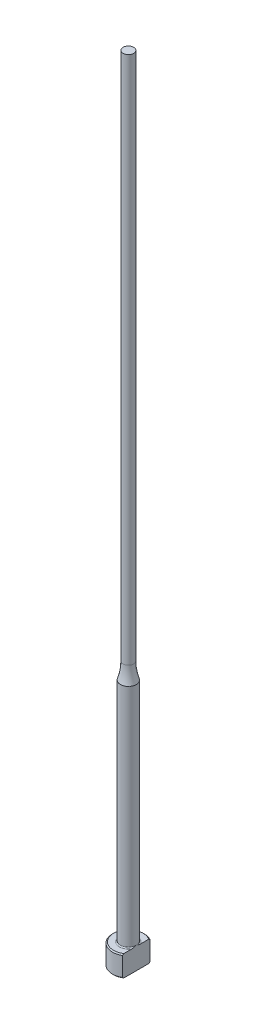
from build123d import *
from build123d.topology import SkipClean

# Parameters (mm, degrees)
CHAMFER1_SIZE    = 0.2
FILLET1_R        = 0.2
KEYED_HEAD_DEPTH = 151.059988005


with BuildPart() as part:
    # Sketch1 → Revolve1 (revolve)
    with BuildSketch(Plane.XY, mode=Mode.PRIVATE) as revolve1_sk:
        with BuildLine():
            Line((0, 0), (-3, 0))
            Line((-3, 0), (-3, 4))
            Line((-3, 4), (-1.5, 4))
            Line((-1.5, 4), (-1.5, 46.877501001))
            ThreePointArc((-1.5, 46.877501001), (-1.125791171, 48.41886117), (-1, 50))
            Line((-1, 50), (-1, 150))
            Line((-1, 150), (0, 150))
            Line((0, 150), (0, 0))
        make_face()
    revolve(revolve1_sk.sketch.rotate(Axis((0, 259.958771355, 0), (0, -1, 0)), 270), axis=Axis((0, 259.958771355, 0), (0, -1, 0)))

    # Chamfer1
    chamfer1_edges = [part.edges().sort_by_distance(p)[0] for p in [
        (0, 0, -3),
        (0, 4, -3),
    ]]
    chamfer(chamfer1_edges, length=CHAMFER1_SIZE)

    # Fillet1
    fillet1_edges = [part.edges().sort_by_distance(p)[0] for p in [
        (0, 4, -1.5),
    ]]
    fillet(fillet1_edges, radius=FILLET1_R)

    # Sketch2 → Keyed Head (cut, through all)
    with SkipClean():  # the faces are left unmerged after this step: merging them gives an invalid solid
        with BuildSketch(Plane(origin=(0, 0, 0), x_dir=(1, 0, 0), z_dir=(0, 1, 0))):
            with BuildLine():
                Line((1.5, -2.598076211), (1.5, 2.598076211))
                ThreePointArc((1.5, 2.598076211), (3, 0), (1.5, -2.598076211))
            make_face()
        extrude(amount=KEYED_HEAD_DEPTH, mode=Mode.SUBTRACT)


solid = part.part
